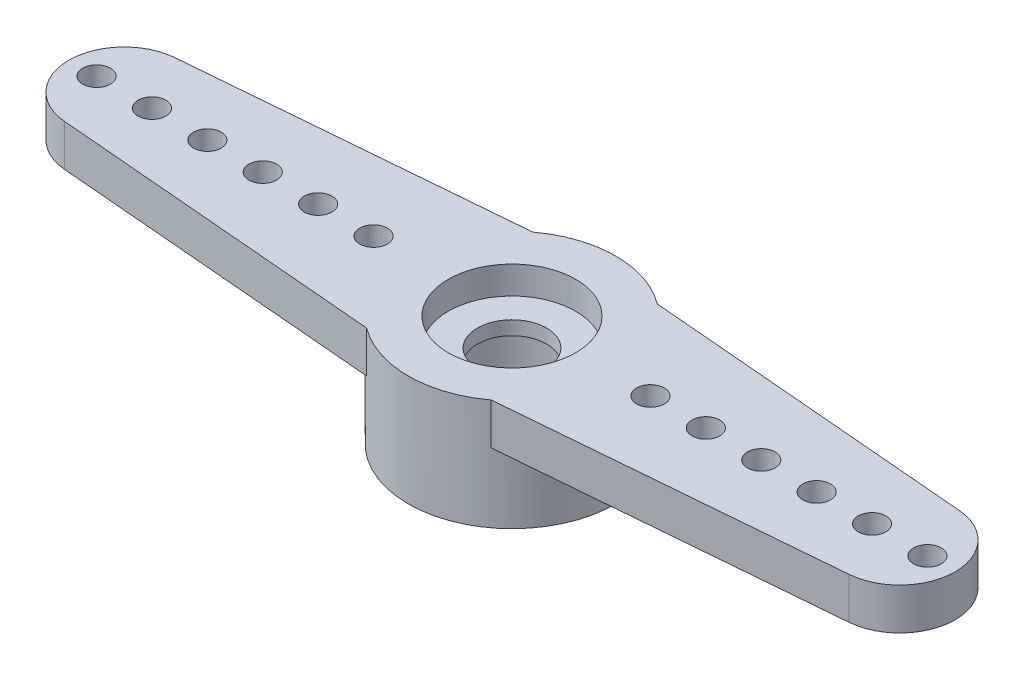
from build123d import *

# Parameters (mm, degrees)
SKETCH1_R           = 3.75
BOSS_EXTRUDE1_DEPTH = 4
SKETCH2_R           = 2.3
CUT_EXTRUDE1_DEPTH  = 1
BOSS_EXTRUDE2_START = -1.5
SKETCH3_R           = 0.5
BOSS_EXTRUDE2_DEPTH = 1.5
SKETCH4_R           = 1.25
CUT_EXTRUDE2_DEPTH  = 4.5
CUT_EXTRUDE3_START  = -2.5
SKETCH5_R           = 2.3
CUT_EXTRUDE3_DEPTH  = 2.5


with BuildPart() as part:
    # Sketch1 → Boss-Extrude1 (new body)
    with BuildSketch(Plane(origin=(0, 0, 0), x_dir=(1, 0, 0), z_dir=(0, 1, 0))):
        with Locations(Location((0, 0, 0), (0, 0, 270))):
            Circle(SKETCH1_R)
    extrude(amount=BOSS_EXTRUDE1_DEPTH)

    # Sketch2 → Cut-Extrude1 (cut)
    with BuildSketch(Plane(origin=(0, 4, 0), x_dir=(1, 0, 0), z_dir=(0, 1, 0))):
        with Locations(Location((0, 0, 0), (0, 0, 270))):
            Circle(SKETCH2_R)
    extrude(amount=-CUT_EXTRUDE1_DEPTH, mode=Mode.SUBTRACT)

    # Sketch3 → Boss-Extrude2 (add)
    # profile 1 of 2: a face of its own
    with BuildSketch(Plane(origin=(0, 4, 0), x_dir=(1, 0, 0), z_dir=(0, 1, 0)).offset(BOSS_EXTRUDE2_START)):
        with BuildLine():
            Line((-14.168399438, 1.992897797), (-2.25, 3))
            ThreePointArc((-2.25, 3), (-3.75, 0), (-2.25, -3))
            Line((-2.25, -3), (-14.168399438, -1.992897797))
            ThreePointArc((-14.168399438, -1.992897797), (-16, 0), (-14.168399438, 1.992897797))
        make_face()
        with Locations(Location((-15, 0, 0), (0, 0, 270))):
            Circle(SKETCH3_R, mode=Mode.SUBTRACT)
        with Locations(Location((-13, 0, 0), (0, 0, 270))):
            Circle(SKETCH3_R, mode=Mode.SUBTRACT)
        with Locations(Location((-11, 0, 0), (0, 0, 270))):
            Circle(SKETCH3_R, mode=Mode.SUBTRACT)
        with Locations(Location((-9, 0, 0), (0, 0, 270))):
            Circle(SKETCH3_R, mode=Mode.SUBTRACT)
        with Locations(Location((-7, 0, 0), (0, 0, 270))):
            Circle(SKETCH3_R, mode=Mode.SUBTRACT)
        with Locations(Location((-5, 0, 0), (0, 0, 270))):
            Circle(SKETCH3_R, mode=Mode.SUBTRACT)
    # profile 2 of 2: a face of its own
    with BuildSketch(Plane(origin=(0, 4, 0), x_dir=(1, 0, 0), z_dir=(0, 1, 0)).offset(BOSS_EXTRUDE2_START)):
        with BuildLine():
            Line((14.168399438, -1.992897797), (2.25, -3))
            ThreePointArc((2.25, -3), (3.75, 0), (2.25, 3))
            Line((2.25, 3), (14.168399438, 1.992897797))
            ThreePointArc((14.168399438, 1.992897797), (16, 0), (14.168399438, -1.992897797))
        make_face()
        with Locations(Location((15, 0, 0), (0, 0, 90))):
            Circle(SKETCH3_R, mode=Mode.SUBTRACT)
        with Locations(Location((5, 0, 0), (0, 0, 90))):
            Circle(SKETCH3_R, mode=Mode.SUBTRACT)
        with Locations(Location((7, 0, 0), (0, 0, 90))):
            Circle(SKETCH3_R, mode=Mode.SUBTRACT)
        with Locations(Location((9, 0, 0), (0, 0, 90))):
            Circle(SKETCH3_R, mode=Mode.SUBTRACT)
        with Locations(Location((11, 0, 0), (0, 0, 90))):
            Circle(SKETCH3_R, mode=Mode.SUBTRACT)
        with Locations(Location((13, 0, 0), (0, 0, 90))):
            Circle(SKETCH3_R, mode=Mode.SUBTRACT)
    extrude(amount=BOSS_EXTRUDE2_DEPTH)

    # Sketch4 → Cut-Extrude2 (cut)
    with BuildSketch(Plane(origin=(0, 3, 0), x_dir=(1, 0, 0), z_dir=(0, 1, 0))):
        with Locations(Location((0, 0, 0), (0, 0, 270))):
            Circle(SKETCH4_R)
    extrude(amount=-CUT_EXTRUDE2_DEPTH, mode=Mode.SUBTRACT)

    # Sketch5 → Cut-Extrude3 (cut)
    with BuildSketch(Plane.XZ.offset(CUT_EXTRUDE3_START)):
        with Locations(Location((0, 0, 0), (0, 0, 90))):
            Circle(SKETCH5_R)
    extrude(amount=CUT_EXTRUDE3_DEPTH, mode=Mode.SUBTRACT)


solid = part.part
